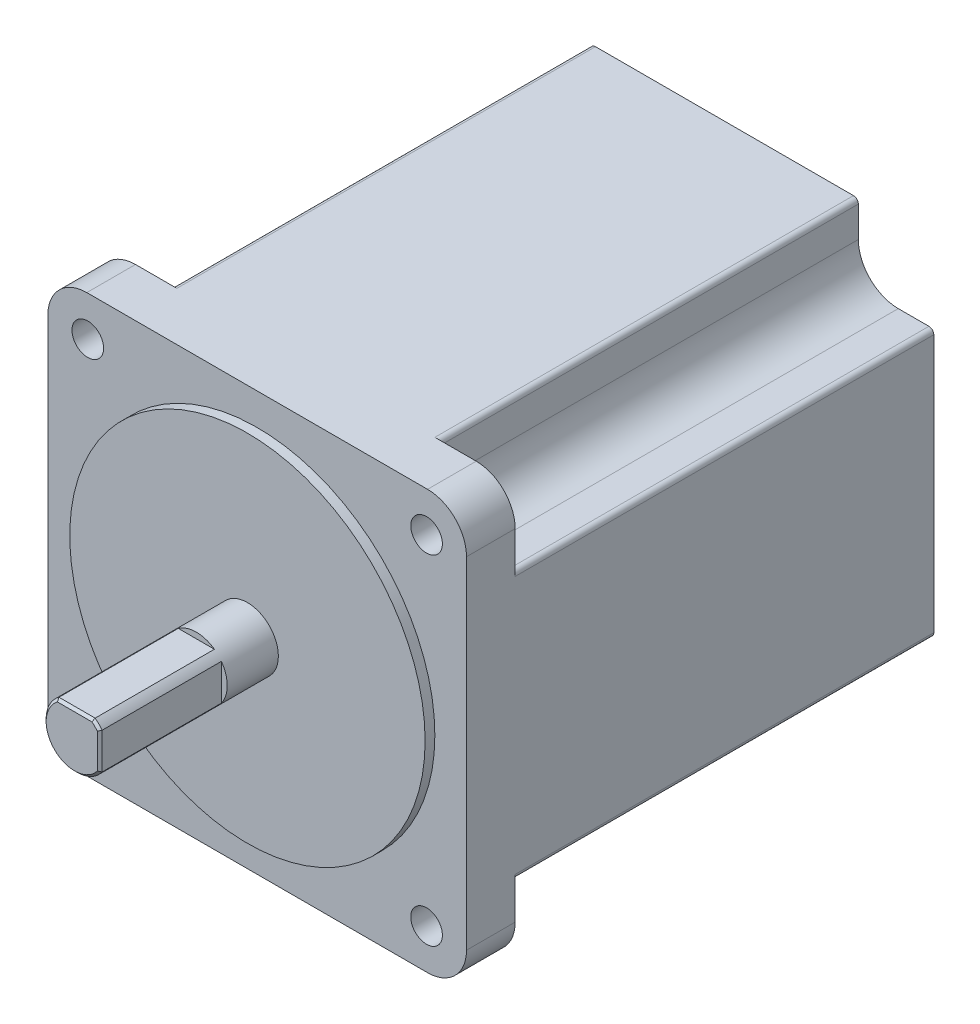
from build123d import *

# Parameters (mm, degrees)
SKETCH_1_R          = 36.5
EXTRUDE_1_DEPTH     = 2
SKETCH_2_R          = 6.35
EXTRUDE_2_DEPTH     = 35.5
CUT_EXTRUDE_1_DEPTH = 25
SKETCH_4_R          = 3.25
EXTRUDE_3_DEPTH     = 96
CUT_EXTRUDE_2_DEPTH = 86
CHAMFER_1_SIZE      = 0.5


with BuildPart() as part:
    # Sketch 1 → Extrude 1 (new body)
    with BuildSketch(Plane.XY):
        Circle(SKETCH_1_R)
    extrude(amount=-EXTRUDE_1_DEPTH)

    # Sketch 2 → Extrude 2 (add)
    with BuildSketch(Plane.XY):
        Circle(SKETCH_2_R)
    extrude(amount=EXTRUDE_2_DEPTH)

    # Sketch 3 → Cut-Extrude 1 (cut)
    with BuildSketch(Plane.XY.offset(35.5)):
        Polygon((0, 5.15), (4.738075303, 5.15), (4.738075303, 8.76543931), (-5.401405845, 8.76543931), (-5.401405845, 5.15), align=None)
        Polygon((5.15, 0), (5.15, -5.069740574), (9.191866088, -5.069740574), (9.191866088, 4.406410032), (5.15, 4.406410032), align=None)
    extrude(amount=-CUT_EXTRUDE_1_DEPTH, mode=Mode.SUBTRACT)

    # Sketch 4 → Extrude 3 (add)
    with BuildSketch(Plane(origin=(0, 0, -2), x_dir=(-1, 0, 0), z_dir=(0, 0, -1))):
        with BuildLine():
            Line((0, 43), (35, 43))
            ThreePointArc((35, 43), (40.656854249, 40.656854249), (43, 35))
            Line((43, 35), (43, -35))
            ThreePointArc((43, -35), (40.656854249, -40.656854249), (35, -43))
            Line((35, -43), (-35, -43))
            ThreePointArc((-35, -43), (-40.656854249, -40.656854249), (-43, -35))
            Line((-43, -35), (-43, 35))
            ThreePointArc((-43, 35), (-40.656854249, 40.656854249), (-35, 43))
            Line((-35, 43), (0, 43))
        make_face()
        with Locations((-34.8, 34.8)):
            Circle(SKETCH_4_R, mode=Mode.SUBTRACT)
        with Locations((34.8, 34.8)):
            Circle(SKETCH_4_R, mode=Mode.SUBTRACT)
        with Locations((34.8, -34.8)):
            Circle(SKETCH_4_R, mode=Mode.SUBTRACT)
        with Locations((-34.8, -34.8)):
            Circle(SKETCH_4_R, mode=Mode.SUBTRACT)
    extrude(amount=EXTRUDE_3_DEPTH)

    # Sketch 5 → Cut-Extrude 2 (cut)
    with BuildSketch(Plane(origin=(0, 0, -98), x_dir=(-1, 0, 0), z_dir=(0, 0, -1))):
        with BuildLine():
            Line((13.75, 43), (26.5, 43))
            ThreePointArc((26.5, 43), (27.207106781, 42.707106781), (27.5, 42))
            Line((27.5, 42), (27.5, 35.7))
            ThreePointArc((27.5, 35.7), (29.901724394, 29.901724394), (35.7, 27.5))
            Line((35.7, 27.5), (42, 27.5))
            ThreePointArc((42, 27.5), (42.707106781, 27.207106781), (43, 26.5))
            Line((43, 26.5), (43, 18.140986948))
            Line((43, 18.140986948), (50.571489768, 18.140986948))
            Line((50.571489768, 18.140986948), (50.571489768, 56.827618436))
            Line((50.571489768, 56.827618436), (13.75, 56.827618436))
            Line((13.75, 56.827618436), (13.75, 43))
        make_face()
        with BuildLine():
            Line((-13.75, 56.827618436), (-13.75, 43))
            Line((-13.75, 43), (-26.5, 43))
            ThreePointArc((-26.5, 43), (-27.207106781, 42.707106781), (-27.5, 42))
            Line((-27.5, 42), (-27.5, 35.7))
            ThreePointArc((-27.5, 35.7), (-29.901724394, 29.901724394), (-35.7, 27.5))
            Line((-35.7, 27.5), (-42, 27.5))
            ThreePointArc((-42, 27.5), (-42.707106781, 27.207106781), (-43, 26.5))
            Line((-43, 26.5), (-43, 18.140986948))
            Line((-43, 18.140986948), (-50.571489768, 18.140986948))
            Line((-50.571489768, 18.140986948), (-50.571489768, 56.827618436))
            Line((-50.571489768, 56.827618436), (-13.75, 56.827618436))
        make_face()
        with BuildLine():
            Line((13.75, -56.827618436), (13.75, -43))
            Line((13.75, -43), (26.5, -43))
            ThreePointArc((26.5, -43), (27.207106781, -42.707106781), (27.5, -42))
            Line((27.5, -42), (27.5, -35.7))
            ThreePointArc((27.5, -35.7), (29.901724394, -29.901724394), (35.7, -27.5))
            Line((35.7, -27.5), (42, -27.5))
            ThreePointArc((42, -27.5), (42.707106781, -27.207106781), (43, -26.5))
            Line((43, -26.5), (43, -18.140986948))
            Line((43, -18.140986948), (50.571489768, -18.140986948))
            Line((50.571489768, -18.140986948), (50.571489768, -56.827618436))
            Line((50.571489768, -56.827618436), (13.75, -56.827618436))
        make_face()
        with BuildLine():
            Line((-13.75, -43), (-26.5, -43))
            ThreePointArc((-26.5, -43), (-27.207106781, -42.707106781), (-27.5, -42))
            Line((-27.5, -42), (-27.5, -35.7))
            ThreePointArc((-27.5, -35.7), (-29.901724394, -29.901724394), (-35.7, -27.5))
            Line((-35.7, -27.5), (-42, -27.5))
            ThreePointArc((-42, -27.5), (-42.707106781, -27.207106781), (-43, -26.5))
            Line((-43, -26.5), (-43, -18.140986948))
            Line((-43, -18.140986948), (-50.571489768, -18.140986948))
            Line((-50.571489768, -18.140986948), (-50.571489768, -56.827618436))
            Line((-50.571489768, -56.827618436), (-13.75, -56.827618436))
            Line((-13.75, -56.827618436), (-13.75, -43))
        make_face()
    extrude(amount=-CUT_EXTRUDE_2_DEPTH, mode=Mode.SUBTRACT)

    # Chamfer 1
    chamfer_1_edges = [part.edges().sort_by_distance(p)[0] for p in [
        (0, 5.15, 35.5),
        (4.490128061, 4.490128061, 35.5),
        (5.15, 0, 35.5),
        (-4.490128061, -4.490128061, 35.5),
    ]]
    chamfer(chamfer_1_edges, length=CHAMFER_1_SIZE)


solid = part.part
